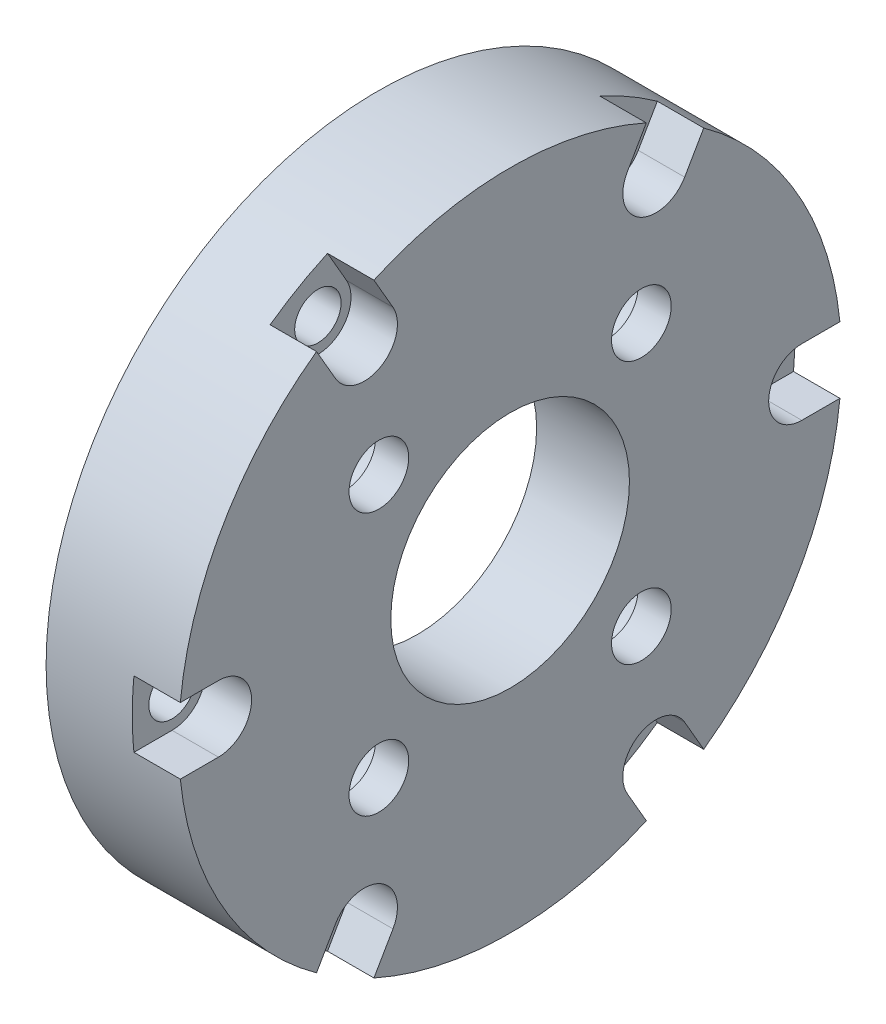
from build123d import *

# Parameters (mm, degrees)
ENL_V_MAT_EXTRU_1_DEPTH                         = 3.5
R_P_TITION_CIRCULAIRE1_COUNT                    = 6
ESQUISSE3_R                                     = 1.75
ENL_V_MAT_EXTRU_2_DEPTH                         = 36.947878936
R_P_TITION_CIRCULAIRE2_COUNT                    = 6
CHAMBRAGE_POUR_VIS_T_TE_CYLINDRIQUE_D           = 4.5
CHAMBRAGE_POUR_VIS_T_TE_CYLINDRIQUE_CBORE_D     = 8
CHAMBRAGE_POUR_VIS_T_TE_CYLINDRIQUE_CBORE_DEPTH = 4.5
R_P_TITION_CIRCULAIRE3_COUNT                    = 4


with BuildPart() as part:
    # Esquisse1 → Base-R_volution (revolve)
    with BuildSketch(Plane.XY, mode=Mode.PRIVATE) as base_r_volution_sk:
        Polygon((-5, 25), (-5, 19), (-2, 19), (-2, 9), (5, 9), (5, 25), align=None)
    revolve(base_r_volution_sk.sketch.rotate(Axis((-14.936373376, 0, 0), (1, 0, 0)), 90), axis=Axis((-14.936373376, 0, 0), (1, 0, 0)))

    # Esquisse2 → Enl_v. mat.-Extru.1 (cut)
    with BuildSketch(Plane(origin=(5, 0, 0), x_dir=(0, 0, -1), z_dir=(1, 0, 0))):
        with BuildLine():
            Line((-22, 2.5), (-25.435164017, 2.5))
            Line((-25.435164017, 2.5), (-25.435164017, -2.5))
            Line((-25.435164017, -2.5), (-22, -2.5))
            ThreePointArc((-22, -2.5), (-19.5, 0), (-22, 2.5))
        make_face()
    enl_v_mat_extru_1 = extrude(amount=-ENL_V_MAT_EXTRU_1_DEPTH, mode=Mode.SUBTRACT)

    # R_p_tition circulaire1: Enl_v. mat.-Extru.1 ×6 about axis
    r_p_tition_circulaire1_axis = Axis((-14.936373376, 0, 0), (1, 0, 0))
    for i in range(1, R_P_TITION_CIRCULAIRE1_COUNT):
        add(enl_v_mat_extru_1.rotate(r_p_tition_circulaire1_axis, i * 360 / R_P_TITION_CIRCULAIRE1_COUNT), mode=Mode.SUBTRACT)

    # Esquisse3 → Enl_v. mat.-Extru.2 (cut, through all)
    with BuildSketch(Plane(origin=(1.5, 0, 0), x_dir=(0, 0, -1), z_dir=(1, 0, 0))):
        with Locations((-22, 0)):
            Circle(ESQUISSE3_R)
    enl_v_mat_extru_2 = extrude(amount=-ENL_V_MAT_EXTRU_2_DEPTH, mode=Mode.SUBTRACT)

    # R_p_tition circulaire2: Enl_v. mat.-Extru.2 ×6 about axis
    r_p_tition_circulaire2_axis = Axis((-14.936373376, 0, 0), (1, 0, 0))
    for i in range(1, R_P_TITION_CIRCULAIRE2_COUNT):
        add(enl_v_mat_extru_2.rotate(r_p_tition_circulaire2_axis, i * 360 / R_P_TITION_CIRCULAIRE2_COUNT), mode=Mode.SUBTRACT)

    # Chambrage pour vis _ t_te cylindrique (through all)
    with Locations(Plane.ZY.offset(2)):
        with Locations((9.899494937, 9.899494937)):
            chambrage_pour_vis_t_te_cylindrique = CounterBoreHole(CHAMBRAGE_POUR_VIS_T_TE_CYLINDRIQUE_D / 2, CHAMBRAGE_POUR_VIS_T_TE_CYLINDRIQUE_CBORE_D / 2, CHAMBRAGE_POUR_VIS_T_TE_CYLINDRIQUE_CBORE_DEPTH)

    # R_p_tition circulaire3: Chambrage pour vis _ t_te cylindrique ×4 about axis
    r_p_tition_circulaire3_axis = Axis((-14.936373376, 0, 0), (1, 0, 0))
    for i in range(1, R_P_TITION_CIRCULAIRE3_COUNT):
        add(chambrage_pour_vis_t_te_cylindrique.rotate(r_p_tition_circulaire3_axis, i * 360 / R_P_TITION_CIRCULAIRE3_COUNT), mode=Mode.SUBTRACT)


solid = part.part
